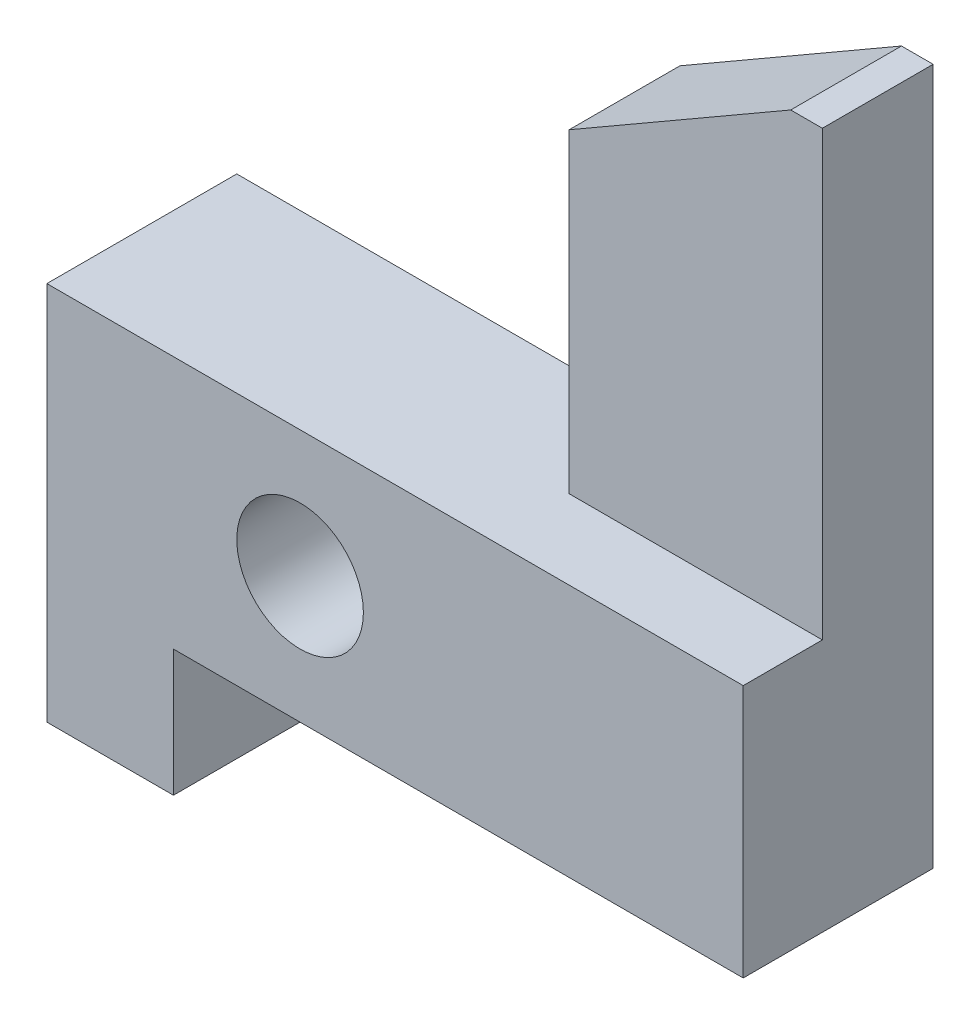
ISO-10303-21;
HEADER;
FILE_DESCRIPTION(('STEP AP214'),'2;1');
FILE_NAME('part.step','',(''),(''),'','','');
FILE_SCHEMA(('AUTOMOTIVE_DESIGN { 1 0 10303 214 1 1 1 1 }'));
ENDSEC;
DATA;
#1=APPLICATION_CONTEXT('core data for automotive mechanical design processes');
#2=APPLICATION_PROTOCOL_DEFINITION('international standard','automotive_design',2000,#1);
#3=PRODUCT_CONTEXT('',#1,'mechanical');
#4=PRODUCT('Part','Part','',(#3));
#5=PRODUCT_RELATED_PRODUCT_CATEGORY('part','',(#4));
#6=PRODUCT_DEFINITION_FORMATION('','',#4);
#7=PRODUCT_DEFINITION_CONTEXT('part definition',#1,'design');
#8=PRODUCT_DEFINITION('design','',#6,#7);
#9=PRODUCT_DEFINITION_SHAPE('','',#8);
#10=(LENGTH_UNIT() NAMED_UNIT(*) SI_UNIT(.MILLI.,.METRE.));
#11=(NAMED_UNIT(*) PLANE_ANGLE_UNIT() SI_UNIT($,.RADIAN.));
#12=(NAMED_UNIT(*) SI_UNIT($,.STERADIAN.) SOLID_ANGLE_UNIT());
#13=UNCERTAINTY_MEASURE_WITH_UNIT(LENGTH_MEASURE(1.E-05),#10,'distance_accuracy_value','');
#14=(GEOMETRIC_REPRESENTATION_CONTEXT(3) GLOBAL_UNCERTAINTY_ASSIGNED_CONTEXT((#13)) GLOBAL_UNIT_ASSIGNED_CONTEXT((#10,
#11,#12)) REPRESENTATION_CONTEXT('',''));
#15=CARTESIAN_POINT('',(0.,0.,0.));
#16=DIRECTION('',(0.,0.,1.));
#17=DIRECTION('',(1.,0.,0.));
#18=AXIS2_PLACEMENT_3D('',#15,#16,#17);
#19=CARTESIAN_POINT('',(22.,4.,6.));
#20=DIRECTION('',(0.,0.,1.));
#21=DIRECTION('',(1.,0.,0.));
#22=AXIS2_PLACEMENT_3D('',#19,#20,#21);
#23=PLANE('',#22);
#24=CARTESIAN_POINT('',(8.,8.,6.));
#25=DIRECTION('',(0.,0.,1.));
#26=DIRECTION('',(1.,0.,0.));
#27=AXIS2_PLACEMENT_3D('',#24,#25,#26);
#28=CIRCLE('',#27,2.);
#29=CARTESIAN_POINT('',(10.,8.,6.));
#30=VERTEX_POINT('',#29);
#31=EDGE_CURVE('E137',#30,#30,#28,.T.);
#32=ORIENTED_EDGE('',*,*,#31,.F.);
#33=EDGE_LOOP('',(#32));
#34=FACE_BOUND('',#33,.T.);
#35=DIRECTION('',(0.,1.,0.));
#36=VECTOR('',#35,1.);
#37=CARTESIAN_POINT('',(22.,4.,6.));
#38=LINE('',#37,#36);
#39=CARTESIAN_POINT('',(22.,4.,6.));
#40=VERTEX_POINT('',#39);
#41=CARTESIAN_POINT('',(22.,12.0000000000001,6.));
#42=VERTEX_POINT('',#41);
#43=EDGE_CURVE('E100',#40,#42,#38,.T.);
#44=ORIENTED_EDGE('',*,*,#43,.T.);
#45=DIRECTION('',(-1.,0.,0.));
#46=VECTOR('',#45,1.);
#47=CARTESIAN_POINT('',(0.,12.,6.));
#48=LINE('',#47,#46);
#49=CARTESIAN_POINT('',(0.,12.,6.));
#50=VERTEX_POINT('',#49);
#51=EDGE_CURVE('E113',#42,#50,#48,.T.);
#52=ORIENTED_EDGE('',*,*,#51,.T.);
#53=DIRECTION('',(0.,-1.,0.));
#54=VECTOR('',#53,1.);
#55=CARTESIAN_POINT('',(0.,0.,6.));
#56=LINE('',#55,#54);
#57=CARTESIAN_POINT('',(0.,0.,6.));
#58=VERTEX_POINT('',#57);
#59=EDGE_CURVE('E107',#50,#58,#56,.T.);
#60=ORIENTED_EDGE('',*,*,#59,.T.);
#61=DIRECTION('',(1.,0.,0.));
#62=VECTOR('',#61,1.);
#63=CARTESIAN_POINT('',(0.,0.,6.));
#64=LINE('',#63,#62);
#65=CARTESIAN_POINT('',(4.,-1.13686837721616E-13,6.));
#66=VERTEX_POINT('',#65);
#67=EDGE_CURVE('E110',#58,#66,#64,.T.);
#68=ORIENTED_EDGE('',*,*,#67,.T.);
#69=DIRECTION('',(0.,1.,0.));
#70=VECTOR('',#69,1.);
#71=CARTESIAN_POINT('',(4.,-1.13686837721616E-13,6.));
#72=LINE('',#71,#70);
#73=CARTESIAN_POINT('',(4.,4.,6.));
#74=VERTEX_POINT('',#73);
#75=EDGE_CURVE('E57',#66,#74,#72,.T.);
#76=ORIENTED_EDGE('',*,*,#75,.T.);
#77=DIRECTION('',(1.,0.,0.));
#78=VECTOR('',#77,1.);
#79=CARTESIAN_POINT('',(4.,4.,6.));
#80=LINE('',#79,#78);
#81=EDGE_CURVE('E156',#74,#40,#80,.T.);
#82=ORIENTED_EDGE('',*,*,#81,.T.);
#83=EDGE_LOOP('',(#44,#52,#60,#68,#76,#82));
#84=FACE_BOUND('',#83,.T.);
#85=ADVANCED_FACE('F33',(#34,#84),#23,.T.);
#86=CARTESIAN_POINT('',(22.,4.,6.));
#87=DIRECTION('',(-1.,0.,0.));
#88=DIRECTION('',(0.,0.,1.));
#89=AXIS2_PLACEMENT_3D('',#86,#87,#88);
#90=PLANE('',#89);
#91=DIRECTION('',(0.,-1.,0.));
#92=VECTOR('',#91,1.);
#93=CARTESIAN_POINT('',(22.,12.0000000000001,3.5));
#94=LINE('',#93,#92);
#95=CARTESIAN_POINT('',(22.,26.0000000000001,3.5));
#96=VERTEX_POINT('',#95);
#97=CARTESIAN_POINT('',(22.,12.0000000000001,3.5));
#98=VERTEX_POINT('',#97);
#99=EDGE_CURVE('E200',#96,#98,#94,.T.);
#100=ORIENTED_EDGE('',*,*,#99,.T.);
#101=DIRECTION('',(0.,0.,1.));
#102=VECTOR('',#101,1.);
#103=CARTESIAN_POINT('',(22.,12.0000000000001,6.));
#104=LINE('',#103,#102);
#105=EDGE_CURVE('E199',#98,#42,#104,.T.);
#106=ORIENTED_EDGE('',*,*,#105,.T.);
#107=ORIENTED_EDGE('',*,*,#43,.F.);
#108=DIRECTION('',(0.,0.,-1.));
#109=VECTOR('',#108,1.);
#110=CARTESIAN_POINT('',(22.,4.,6.));
#111=LINE('',#110,#109);
#112=CARTESIAN_POINT('',(22.,4.,0.));
#113=VERTEX_POINT('',#112);
#114=EDGE_CURVE('E12',#40,#113,#111,.T.);
#115=ORIENTED_EDGE('',*,*,#114,.T.);
#116=DIRECTION('',(0.,1.,0.));
#117=VECTOR('',#116,1.);
#118=CARTESIAN_POINT('',(22.,4.,0.));
#119=LINE('',#118,#117);
#120=CARTESIAN_POINT('',(22.,26.,0.));
#121=VERTEX_POINT('',#120);
#122=EDGE_CURVE('E136',#113,#121,#119,.T.);
#123=ORIENTED_EDGE('',*,*,#122,.T.);
#124=DIRECTION('',(0.,0.,-1.));
#125=VECTOR('',#124,1.);
#126=CARTESIAN_POINT('',(22.,26.,6.));
#127=LINE('',#126,#125);
#128=EDGE_CURVE('E41',#96,#121,#127,.T.);
#129=ORIENTED_EDGE('',*,*,#128,.F.);
#130=EDGE_LOOP('',(#100,#106,#107,#115,#123,#129));
#131=FACE_BOUND('',#130,.T.);
#132=ADVANCED_FACE('F176',(#131),#90,.F.);
#133=CARTESIAN_POINT('',(21.,26.,6.));
#134=DIRECTION('',(0.,-1.,0.));
#135=DIRECTION('',(0.,0.,-1.));
#136=AXIS2_PLACEMENT_3D('',#133,#134,#135);
#137=PLANE('',#136);
#138=DIRECTION('',(1.,0.,0.));
#139=VECTOR('',#138,1.);
#140=CARTESIAN_POINT('',(0.,26.0000000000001,3.5));
#141=LINE('',#140,#139);
#142=CARTESIAN_POINT('',(21.0000000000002,26.0000000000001,3.5));
#143=VERTEX_POINT('',#142);
#144=EDGE_CURVE('E174',#143,#96,#141,.T.);
#145=ORIENTED_EDGE('',*,*,#144,.T.);
#146=ORIENTED_EDGE('',*,*,#128,.T.);
#147=DIRECTION('',(-1.,0.,0.));
#148=VECTOR('',#147,1.);
#149=CARTESIAN_POINT('',(21.,26.,0.));
#150=LINE('',#149,#148);
#151=CARTESIAN_POINT('',(21.,26.,0.));
#152=VERTEX_POINT('',#151);
#153=EDGE_CURVE('E140',#121,#152,#150,.T.);
#154=ORIENTED_EDGE('',*,*,#153,.T.);
#155=DIRECTION('',(0.,0.,-1.));
#156=VECTOR('',#155,1.);
#157=CARTESIAN_POINT('',(21.,26.,6.));
#158=LINE('',#157,#156);
#159=EDGE_CURVE('E164',#143,#152,#158,.T.);
#160=ORIENTED_EDGE('',*,*,#159,.F.);
#161=EDGE_LOOP('',(#145,#146,#154,#160));
#162=FACE_BOUND('',#161,.T.);
#163=ADVANCED_FACE('F168',(#162),#137,.F.);
#164=CARTESIAN_POINT('',(14.,21.9585481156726,6.));
#165=DIRECTION('',(0.500000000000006,-0.866025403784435,0.));
#166=DIRECTION('',(0.866025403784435,0.500000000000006,0.));
#167=AXIS2_PLACEMENT_3D('',#164,#165,#166);
#168=PLANE('',#167);
#169=DIRECTION('',(-0.866025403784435,-0.500000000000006,0.));
#170=VECTOR('',#169,1.);
#171=CARTESIAN_POINT('',(14.,21.9585481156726,3.5));
#172=LINE('',#171,#170);
#173=CARTESIAN_POINT('',(14.,21.9585481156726,3.5));
#174=VERTEX_POINT('',#173);
#175=EDGE_CURVE('E190',#143,#174,#172,.T.);
#176=ORIENTED_EDGE('',*,*,#175,.F.);
#177=ORIENTED_EDGE('',*,*,#159,.T.);
#178=DIRECTION('',(-0.866025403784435,-0.500000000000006,0.));
#179=VECTOR('',#178,1.);
#180=CARTESIAN_POINT('',(14.,21.9585481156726,0.));
#181=LINE('',#180,#179);
#182=CARTESIAN_POINT('',(14.,21.9585481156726,0.));
#183=VERTEX_POINT('',#182);
#184=EDGE_CURVE('E143',#152,#183,#181,.T.);
#185=ORIENTED_EDGE('',*,*,#184,.T.);
#186=DIRECTION('',(0.,0.,-1.));
#187=VECTOR('',#186,1.);
#188=CARTESIAN_POINT('',(14.,21.9585481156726,6.));
#189=LINE('',#188,#187);
#190=EDGE_CURVE('E162',#174,#183,#189,.T.);
#191=ORIENTED_EDGE('',*,*,#190,.F.);
#192=EDGE_LOOP('',(#176,#177,#185,#191));
#193=FACE_BOUND('',#192,.T.);
#194=ADVANCED_FACE('F187',(#193),#168,.F.);
#195=CARTESIAN_POINT('',(14.,12.,6.));
#196=DIRECTION('',(1.,0.,0.));
#197=DIRECTION('',(0.,0.,-1.));
#198=AXIS2_PLACEMENT_3D('',#195,#196,#197);
#199=PLANE('',#198);
#200=DIRECTION('',(0.,-1.,0.));
#201=VECTOR('',#200,1.);
#202=CARTESIAN_POINT('',(14.,12.,3.5));
#203=LINE('',#202,#201);
#204=CARTESIAN_POINT('',(14.,12.,3.5));
#205=VERTEX_POINT('',#204);
#206=EDGE_CURVE('E212',#174,#205,#203,.T.);
#207=ORIENTED_EDGE('',*,*,#206,.F.);
#208=ORIENTED_EDGE('',*,*,#190,.T.);
#209=DIRECTION('',(0.,-1.,0.));
#210=VECTOR('',#209,1.);
#211=CARTESIAN_POINT('',(14.,12.,0.));
#212=LINE('',#211,#210);
#213=CARTESIAN_POINT('',(14.,12.,0.));
#214=VERTEX_POINT('',#213);
#215=EDGE_CURVE('E146',#183,#214,#212,.T.);
#216=ORIENTED_EDGE('',*,*,#215,.T.);
#217=DIRECTION('',(0.,0.,-1.));
#218=VECTOR('',#217,1.);
#219=CARTESIAN_POINT('',(14.,12.,6.));
#220=LINE('',#219,#218);
#221=EDGE_CURVE('E160',#205,#214,#220,.T.);
#222=ORIENTED_EDGE('',*,*,#221,.F.);
#223=EDGE_LOOP('',(#207,#208,#216,#222));
#224=FACE_BOUND('',#223,.T.);
#225=ADVANCED_FACE('F256',(#224),#199,.F.);
#226=CARTESIAN_POINT('',(22.,4.,0.));
#227=DIRECTION('',(0.,0.,1.));
#228=DIRECTION('',(1.,0.,0.));
#229=AXIS2_PLACEMENT_3D('',#226,#227,#228);
#230=PLANE('',#229);
#231=DIRECTION('',(1.,0.,0.));
#232=VECTOR('',#231,1.);
#233=CARTESIAN_POINT('',(4.,4.,0.));
#234=LINE('',#233,#232);
#235=CARTESIAN_POINT('',(4.,4.,0.));
#236=VERTEX_POINT('',#235);
#237=EDGE_CURVE('E133',#236,#113,#234,.T.);
#238=ORIENTED_EDGE('',*,*,#237,.F.);
#239=DIRECTION('',(0.,1.,0.));
#240=VECTOR('',#239,1.);
#241=CARTESIAN_POINT('',(4.,-1.13686837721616E-13,0.));
#242=LINE('',#241,#240);
#243=CARTESIAN_POINT('',(4.,-1.13686837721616E-13,0.));
#244=VERTEX_POINT('',#243);
#245=EDGE_CURVE('E92',#244,#236,#242,.T.);
#246=ORIENTED_EDGE('',*,*,#245,.F.);
#247=DIRECTION('',(1.,0.,0.));
#248=VECTOR('',#247,1.);
#249=CARTESIAN_POINT('',(0.,0.,0.));
#250=LINE('',#249,#248);
#251=CARTESIAN_POINT('',(0.,0.,0.));
#252=VERTEX_POINT('',#251);
#253=EDGE_CURVE('E153',#252,#244,#250,.T.);
#254=ORIENTED_EDGE('',*,*,#253,.F.);
#255=DIRECTION('',(0.,-1.,0.));
#256=VECTOR('',#255,1.);
#257=CARTESIAN_POINT('',(0.,0.,0.));
#258=LINE('',#257,#256);
#259=CARTESIAN_POINT('',(0.,12.,0.));
#260=VERTEX_POINT('',#259);
#261=EDGE_CURVE('E121',#260,#252,#258,.T.);
#262=ORIENTED_EDGE('',*,*,#261,.F.);
#263=DIRECTION('',(-1.,0.,0.));
#264=VECTOR('',#263,1.);
#265=CARTESIAN_POINT('',(0.,12.,0.));
#266=LINE('',#265,#264);
#267=EDGE_CURVE('E149',#214,#260,#266,.T.);
#268=ORIENTED_EDGE('',*,*,#267,.F.);
#269=ORIENTED_EDGE('',*,*,#215,.F.);
#270=ORIENTED_EDGE('',*,*,#184,.F.);
#271=ORIENTED_EDGE('',*,*,#153,.F.);
#272=ORIENTED_EDGE('',*,*,#122,.F.);
#273=EDGE_LOOP('',(#238,#246,#254,#262,#268,#269,#270,#271,#272));
#274=FACE_BOUND('',#273,.T.);
#275=CARTESIAN_POINT('',(8.,8.,0.));
#276=DIRECTION('',(0.,0.,1.));
#277=DIRECTION('',(1.,0.,0.));
#278=AXIS2_PLACEMENT_3D('',#275,#276,#277);
#279=CIRCLE('',#278,2.);
#280=CARTESIAN_POINT('',(10.,8.,0.));
#281=VERTEX_POINT('',#280);
#282=EDGE_CURVE('E206',#281,#281,#279,.T.);
#283=ORIENTED_EDGE('',*,*,#282,.T.);
#284=EDGE_LOOP('',(#283));
#285=FACE_BOUND('',#284,.T.);
#286=ADVANCED_FACE('F180',(#274,#285),#230,.F.);
#287=CARTESIAN_POINT('',(4.,4.,6.));
#288=DIRECTION('',(0.,1.,0.));
#289=DIRECTION('',(0.,0.,1.));
#290=AXIS2_PLACEMENT_3D('',#287,#288,#289);
#291=PLANE('',#290);
#292=CARTESIAN_POINT('',(14.,4.,3.));
#293=DIRECTION('',(0.,-1.,0.));
#294=DIRECTION('',(0.,0.,-1.));
#295=AXIS2_PLACEMENT_3D('',#292,#293,#294);
#296=CIRCLE('',#295,1.75);
#297=CARTESIAN_POINT('',(14.,4.,1.25));
#298=VERTEX_POINT('',#297);
#299=EDGE_CURVE('E218',#298,#298,#296,.T.);
#300=ORIENTED_EDGE('',*,*,#299,.F.);
#301=EDGE_LOOP('',(#300));
#302=FACE_BOUND('',#301,.T.);
#303=ORIENTED_EDGE('',*,*,#237,.T.);
#304=ORIENTED_EDGE('',*,*,#114,.F.);
#305=ORIENTED_EDGE('',*,*,#81,.F.);
#306=DIRECTION('',(0.,0.,-1.));
#307=VECTOR('',#306,1.);
#308=CARTESIAN_POINT('',(4.,4.,6.));
#309=LINE('',#308,#307);
#310=EDGE_CURVE('E129',#74,#236,#309,.T.);
#311=ORIENTED_EDGE('',*,*,#310,.T.);
#312=EDGE_LOOP('',(#303,#304,#305,#311));
#313=FACE_BOUND('',#312,.T.);
#314=ADVANCED_FACE('F35',(#302,#313),#291,.F.);
#315=CARTESIAN_POINT('',(0.,12.,6.));
#316=DIRECTION('',(0.,-1.,0.));
#317=DIRECTION('',(0.,0.,-1.));
#318=AXIS2_PLACEMENT_3D('',#315,#316,#317);
#319=PLANE('',#318);
#320=ORIENTED_EDGE('',*,*,#51,.F.);
#321=ORIENTED_EDGE('',*,*,#105,.F.);
#322=DIRECTION('',(1.,0.,0.));
#323=VECTOR('',#322,1.);
#324=CARTESIAN_POINT('',(0.,12.0000000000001,3.5));
#325=LINE('',#324,#323);
#326=EDGE_CURVE('E48',#205,#98,#325,.T.);
#327=ORIENTED_EDGE('',*,*,#326,.F.);
#328=ORIENTED_EDGE('',*,*,#221,.T.);
#329=ORIENTED_EDGE('',*,*,#267,.T.);
#330=DIRECTION('',(0.,0.,-1.));
#331=VECTOR('',#330,1.);
#332=CARTESIAN_POINT('',(0.,12.,6.));
#333=LINE('',#332,#331);
#334=EDGE_CURVE('E124',#50,#260,#333,.T.);
#335=ORIENTED_EDGE('',*,*,#334,.F.);
#336=EDGE_LOOP('',(#320,#321,#327,#328,#329,#335));
#337=FACE_BOUND('',#336,.T.);
#338=ADVANCED_FACE('F198',(#337),#319,.F.);
#339=CARTESIAN_POINT('',(0.,0.,6.));
#340=DIRECTION('',(1.,0.,0.));
#341=DIRECTION('',(0.,0.,-1.));
#342=AXIS2_PLACEMENT_3D('',#339,#340,#341);
#343=PLANE('',#342);
#344=ORIENTED_EDGE('',*,*,#261,.T.);
#345=DIRECTION('',(0.,0.,-1.));
#346=VECTOR('',#345,1.);
#347=CARTESIAN_POINT('',(0.,0.,6.));
#348=LINE('',#347,#346);
#349=EDGE_CURVE('E118',#58,#252,#348,.T.);
#350=ORIENTED_EDGE('',*,*,#349,.F.);
#351=ORIENTED_EDGE('',*,*,#59,.F.);
#352=ORIENTED_EDGE('',*,*,#334,.T.);
#353=EDGE_LOOP('',(#344,#350,#351,#352));
#354=FACE_BOUND('',#353,.T.);
#355=ADVANCED_FACE('F119',(#354),#343,.F.);
#356=CARTESIAN_POINT('',(0.,0.,6.));
#357=DIRECTION('',(0.,1.,0.));
#358=DIRECTION('',(-1.,0.,0.));
#359=AXIS2_PLACEMENT_3D('',#356,#357,#358);
#360=PLANE('',#359);
#361=ORIENTED_EDGE('',*,*,#253,.T.);
#362=DIRECTION('',(0.,0.,-1.));
#363=VECTOR('',#362,1.);
#364=CARTESIAN_POINT('',(4.,-1.13686837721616E-13,6.));
#365=LINE('',#364,#363);
#366=EDGE_CURVE('E125',#66,#244,#365,.T.);
#367=ORIENTED_EDGE('',*,*,#366,.F.);
#368=ORIENTED_EDGE('',*,*,#67,.F.);
#369=ORIENTED_EDGE('',*,*,#349,.T.);
#370=EDGE_LOOP('',(#361,#367,#368,#369));
#371=FACE_BOUND('',#370,.T.);
#372=ADVANCED_FACE('F127',(#371),#360,.F.);
#373=CARTESIAN_POINT('',(4.,-1.13686837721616E-13,6.));
#374=DIRECTION('',(-1.,0.,0.));
#375=DIRECTION('',(0.,0.,1.));
#376=AXIS2_PLACEMENT_3D('',#373,#374,#375);
#377=PLANE('',#376);
#378=ORIENTED_EDGE('',*,*,#245,.T.);
#379=ORIENTED_EDGE('',*,*,#310,.F.);
#380=ORIENTED_EDGE('',*,*,#75,.F.);
#381=ORIENTED_EDGE('',*,*,#366,.T.);
#382=EDGE_LOOP('',(#378,#379,#380,#381));
#383=FACE_BOUND('',#382,.T.);
#384=ADVANCED_FACE('F235',(#383),#377,.F.);
#385=CARTESIAN_POINT('',(8.,8.,6.));
#386=DIRECTION('',(0.,0.,-1.));
#387=DIRECTION('',(-1.,0.,0.));
#388=AXIS2_PLACEMENT_3D('',#385,#386,#387);
#389=CYLINDRICAL_SURFACE('',#388,2.);
#390=ORIENTED_EDGE('',*,*,#31,.T.);
#391=EDGE_LOOP('',(#390));
#392=FACE_BOUND('',#391,.T.);
#393=ORIENTED_EDGE('',*,*,#282,.F.);
#394=EDGE_LOOP('',(#393));
#395=FACE_BOUND('',#394,.T.);
#396=ADVANCED_FACE('F237',(#392,#395),#389,.F.);
#397=CARTESIAN_POINT('',(0.,12.0000000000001,3.5));
#398=DIRECTION('',(0.,0.,1.));
#399=DIRECTION('',(1.,0.,0.));
#400=AXIS2_PLACEMENT_3D('',#397,#398,#399);
#401=PLANE('',#400);
#402=ORIENTED_EDGE('',*,*,#175,.T.);
#403=ORIENTED_EDGE('',*,*,#206,.T.);
#404=ORIENTED_EDGE('',*,*,#326,.T.);
#405=ORIENTED_EDGE('',*,*,#99,.F.);
#406=ORIENTED_EDGE('',*,*,#144,.F.);
#407=EDGE_LOOP('',(#402,#403,#404,#405,#406));
#408=FACE_BOUND('',#407,.T.);
#409=ADVANCED_FACE('F229',(#408),#401,.T.);
#410=CARTESIAN_POINT('',(14.,7.,3.));
#411=DIRECTION('',(0.,-1.,0.));
#412=DIRECTION('',(0.,0.,-1.));
#413=AXIS2_PLACEMENT_3D('',#410,#411,#412);
#414=CYLINDRICAL_SURFACE('',#413,1.75);
#415=CARTESIAN_POINT('',(14.,7.,3.));
#416=DIRECTION('',(0.,-1.,0.));
#417=DIRECTION('',(0.,0.,-1.));
#418=AXIS2_PLACEMENT_3D('',#415,#416,#417);
#419=CIRCLE('',#418,1.75);
#420=CARTESIAN_POINT('',(14.,7.,1.25));
#421=VERTEX_POINT('',#420);
#422=EDGE_CURVE('E217',#421,#421,#419,.T.);
#423=ORIENTED_EDGE('',*,*,#422,.F.);
#424=EDGE_LOOP('',(#423));
#425=FACE_BOUND('',#424,.T.);
#426=ORIENTED_EDGE('',*,*,#299,.T.);
#427=EDGE_LOOP('',(#426));
#428=FACE_BOUND('',#427,.T.);
#429=ADVANCED_FACE('F226',(#425,#428),#414,.F.);
#430=CARTESIAN_POINT('',(14.,7.,3.));
#431=DIRECTION('',(0.,-1.,0.));
#432=DIRECTION('',(0.,0.,-1.));
#433=AXIS2_PLACEMENT_3D('',#430,#431,#432);
#434=PLANE('',#433);
#435=ORIENTED_EDGE('',*,*,#422,.T.);
#436=EDGE_LOOP('',(#435));
#437=FACE_BOUND('',#436,.T.);
#438=ADVANCED_FACE('F224',(#437),#434,.T.);
#439=CLOSED_SHELL('',(#85,#132,#163,#194,#225,#286,#314,#338,#355,#372,#384,#396,#409,#429,#438));
#440=MANIFOLD_SOLID_BREP('B2',#439);
#441=ADVANCED_BREP_SHAPE_REPRESENTATION('',(#18,#440),#14);
#442=SHAPE_DEFINITION_REPRESENTATION(#9,#441);
ENDSEC;
END-ISO-10303-21;
